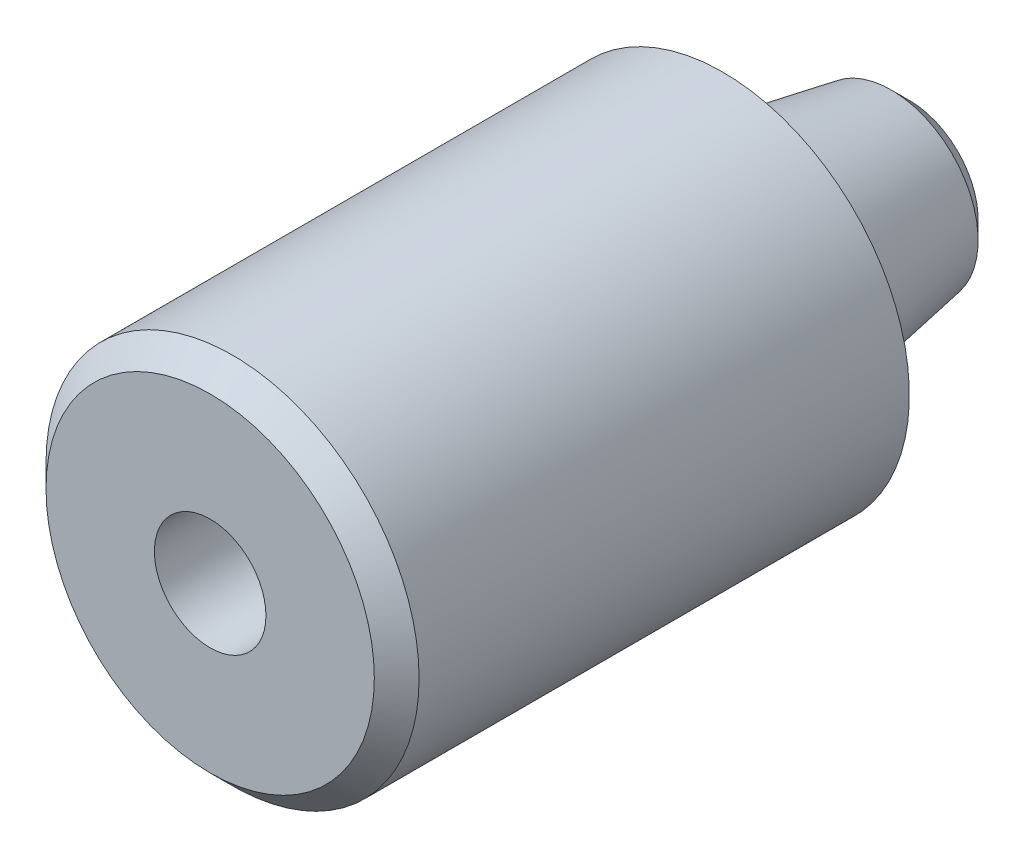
from build123d import *

# Parameters (mm, degrees)
CHAMFER1_SIZE              = 0.762
CHAMFER2_SIZE              = 0.508
CHAMFER2_SIZE2             = 0.62626395
F_10_24_TAPPED_HOLE1_D     = 3.7973
F_10_24_TAPPED_HOLE1_DEPTH = 12.7
F_10_24_TAPPED_HOLE1_TIP   = 1.140824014


with BuildPart() as part:
    # Sketch1 → Revolve1 (revolve)
    with BuildSketch(Plane(origin=(0, 0, 0), x_dir=(0, 0, -1), z_dir=(1, 0, 0)), mode=Mode.PRIVATE) as revolve1_sk:
        Polygon((0, 0), (0, 6.35), (17.4498, 6.35), (17.4498, 3.96875), (23.7998, 2.849073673), (23.7998, 0), align=None)
    revolve(revolve1_sk.sketch.rotate(Axis((0, 0, 0), (0, 0, 1)), 90), axis=Axis((0, 0, 0), (0, 0, 1)))

    # Chamfer1
    chamfer1_edges = [part.edges().sort_by_distance(p)[0] for p in [
        (6.35, 0, 0),
    ]]
    chamfer(chamfer1_edges, length=CHAMFER1_SIZE)

    # Chamfer2
    chamfer2_edges = [part.edges().sort_by_distance(p)[0] for p in [
        (2.849073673, 0, -23.7998),
    ]]
    chamfer2_side = [part.faces().sort_by_distance(p)[0] for p in [
        (0, 0, -23.7998),
    ]]
    chamfer(chamfer2_edges, length=CHAMFER2_SIZE, length2=CHAMFER2_SIZE2, reference=chamfer2_side[0])

    # 10-24 Tapped Hole1
    with Locations(Plane.XY):
        with Locations((0, 0)):
            Hole(F_10_24_TAPPED_HOLE1_D / 2, depth=F_10_24_TAPPED_HOLE1_DEPTH)
            with Locations((0, 0, -(F_10_24_TAPPED_HOLE1_DEPTH + F_10_24_TAPPED_HOLE1_TIP / 2))):  # 118° drill point
                Cone(0, F_10_24_TAPPED_HOLE1_D / 2, F_10_24_TAPPED_HOLE1_TIP, mode=Mode.SUBTRACT)


solid = part.part
